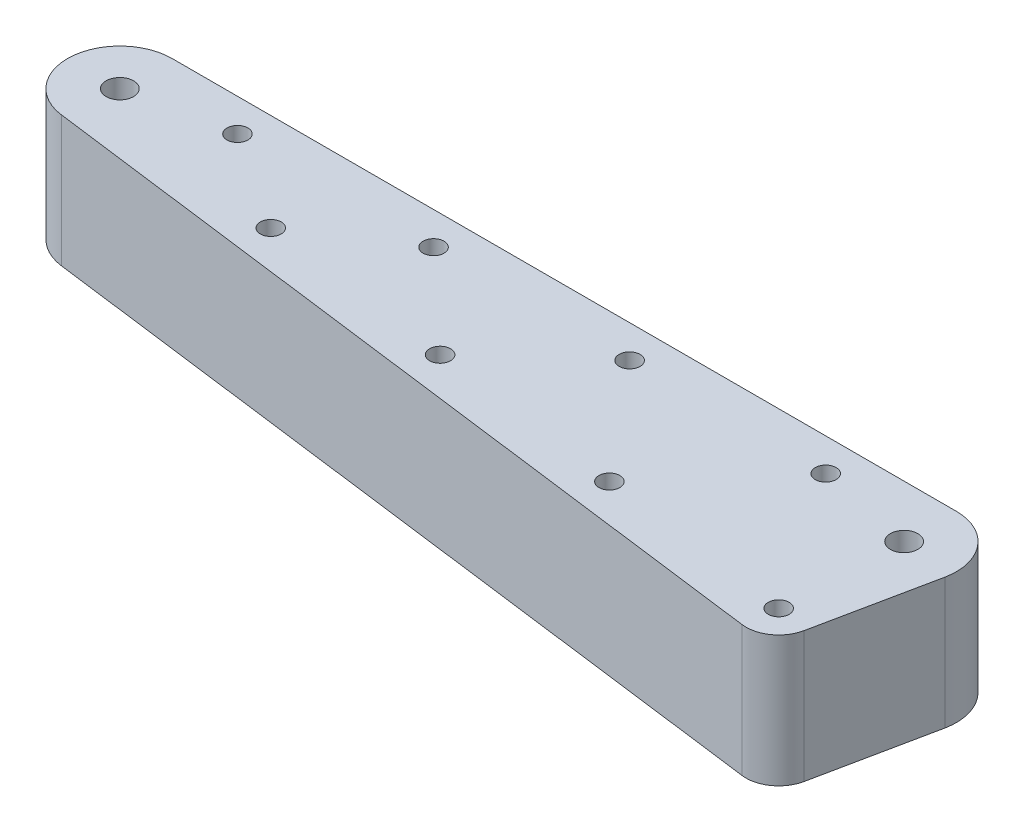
from build123d import *

# Parameters (mm, degrees)
SKETCH_1_R          = 2.1
SKETCH_1_R_2        = 1.6
EXTRUDE_1_DEPTH     = 4
SKETCH_2_R          = 1.6
CUT_EXTRUDE_1_DEPTH = 166.082101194
EXTRUDE_START       = 20
SKETCH_3_R          = 2.1
SKETCH_3_R_2        = 1.6
EXTRUDE_2_DEPTH     = 20
SKETCH_4_W          = 345
SKETCH_4_H          = 80
CUT_EXTRUDE_2_DEPTH = 4
CUT_EXTRUDE_3_DEPTH = 0.5


with BuildPart() as part:
    # Sketch 1 → Extrude 1 (new body)
    with BuildSketch(Plane(origin=(0, 0, 0), x_dir=(1, 0, 0), z_dir=(0, 1, 0))):
        with BuildLine():
            Line((153.614907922, -27.933920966), (-1.02610823, -7.933920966))
            ThreePointArc((-1.02610823, -7.933920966), (-7.98346315, 0.514116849), (0, 8))
            Line((0, 8), (120, 8))
            ThreePointArc((120, 8), (122.070552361, 7.72740661), (124, 6.92820323))
            Line((124, 6.92820323), (158.641016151, -13.07179677))
            ThreePointArc((158.641016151, -13.07179677), (162.219386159, -22.562871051), (153.614907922, -27.933920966))
        make_face()
        with Locations(Location((0, 0, 0), (0, 0, 270))):
            Circle(SKETCH_1_R, mode=Mode.SUBTRACT)
        with Locations(Location((154.641016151, -20, 0), (0, 0, 270))):
            Circle(SKETCH_1_R_2, mode=Mode.SUBTRACT)
        with Locations(Location((120, 0, 0), (0, 0, 270))):
            Circle(SKETCH_1_R, mode=Mode.SUBTRACT)
    extrude(amount=EXTRUDE_1_DEPTH)

    # Sketch 2 → Cut-Extrude 1 (cut, through all)
    with BuildSketch(Plane(origin=(0, 4, 0), x_dir=(1, 0, 0), z_dir=(0, 1, 0))):
        with Locations(Location((15, 3, 0), (0, 0, 270))):
            Circle(SKETCH_2_R)
        with Locations(Location((45, 3, 0), (0, 0, 270))):
            Circle(SKETCH_2_R)
        with Locations(Location((75, 3, 0), (0, 0, 270))):
            Circle(SKETCH_2_R)
        with Locations(Location((105, 3, 0), (0, 0, 270))):
            Circle(SKETCH_2_R)
        with Locations(Location((30, -6.90493983, 0), (0, 0, 270))):
            Circle(SKETCH_2_R)
        with Locations(Location((59.752203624, -10.752845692, 0), (0, 0, 270))):
            Circle(SKETCH_2_R)
        with Locations(Location((89.504407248, -14.600751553, 0), (0, 0, 270))):
            Circle(SKETCH_2_R)
        with Locations(Location((119.256610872, -18.448657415, 0), (0, 0, 270))):
            Circle(SKETCH_2_R)
    extrude(amount=-CUT_EXTRUDE_1_DEPTH, mode=Mode.SUBTRACT)

    # Sketch 3 → Extrude 2 (add)
    with BuildSketch(Plane(origin=(0, 4, 0), x_dir=(1, 0, 0), z_dir=(0, 1, 0)).offset(EXTRUDE_START)):
        with BuildLine():
            Line((-1.02610823, -7.933920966), (118.615293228, -23.407358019))
            ThreePointArc((118.615293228, -23.407358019), (122.159141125, -22.519937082), (124.153458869, -19.459043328))
            Line((124.153458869, -19.459043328), (127.834956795, -1.616617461))
            ThreePointArc((127.834956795, -1.616617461), (126.202134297, 5.053071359), (120, 8))
            Line((120, 8), (0, 8))
            ThreePointArc((0, 8), (-7.98346315, 0.514116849), (-1.02610823, -7.933920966))
        make_face()
        with Locations(Location((0, 0, 0), (0, 0, 270))):
            Circle(SKETCH_3_R, mode=Mode.SUBTRACT)
        with Locations(Location((120, 0, 0), (0, 0, 270))):
            Circle(SKETCH_3_R, mode=Mode.SUBTRACT)
        with Locations(Location((15, 3, 0), (0, 0, 270))):
            Circle(SKETCH_3_R_2, mode=Mode.SUBTRACT)
        with Locations(Location((30, -6.90493983, 0), (0, 0, 270))):
            Circle(SKETCH_3_R_2, mode=Mode.SUBTRACT)
        with Locations(Location((45, 3, 0), (0, 0, 270))):
            Circle(SKETCH_3_R_2, mode=Mode.SUBTRACT)
        with Locations(Location((75, 3, 0), (0, 0, 270))):
            Circle(SKETCH_3_R_2, mode=Mode.SUBTRACT)
        with Locations(Location((105, 3, 0), (0, 0, 270))):
            Circle(SKETCH_3_R_2, mode=Mode.SUBTRACT)
        with Locations(Location((59.752203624, -10.752845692, 0), (0, 0, 270))):
            Circle(SKETCH_3_R_2, mode=Mode.SUBTRACT)
        with Locations(Location((89.504407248, -14.600751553, 0), (0, 0, 270))):
            Circle(SKETCH_3_R_2, mode=Mode.SUBTRACT)
        with Locations(Location((119.256610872, -18.448657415, 0), (0, 0, 270))):
            Circle(SKETCH_3_R_2, mode=Mode.SUBTRACT)
    extrude(amount=-EXTRUDE_2_DEPTH)

    # Sketch 4 → Cut-Extrude 2 (cut)
    with BuildSketch(Plane.XZ):
        Rectangle(SKETCH_4_W, SKETCH_4_H)
    extrude(amount=-CUT_EXTRUDE_2_DEPTH, mode=Mode.SUBTRACT)

    # Sketch 5 → Cut-Extrude 3 (cut)
    with BuildSketch(Plane(origin=(0, 0, -8), x_dir=(-1, 0, 0), z_dir=(0, 0, -1))):
        with BuildLine():
            Line((-71.476171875, 9.853125), (-73.286328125, 12.5))
            Line((-73.286328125, 12.5), (-75.14296875, 9.853125))
            add(Edge.make_bspline(
                [(-75.14296875, 9.853125), (-75.207101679, 9.767004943), (-75.327352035, 9.605528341), (-75.503951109, 9.386404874), (-75.665851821, 9.206734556), (-75.815069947, 9.061897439), (-75.968594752, 8.948558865), (-76.14250525, 8.881233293), (-76.330412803, 8.830091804), (-76.463278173, 8.826736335), (-76.53203125, 8.825)],
                knots=[0, 0, 0, 0, 1.424737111, 2.671406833, 3.733105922, 4.631441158, 5.430042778, 6.243165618, 7.090901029, 8, 8, 8, 8], degree=3))
            add(Edge.make_bspline(
                [(-76.53203125, 8.825), (-76.608942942, 8.828636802), (-76.758444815, 8.835706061), (-76.973915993, 8.892209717), (-77.171326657, 8.985994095), (-77.343919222, 9.117308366), (-77.488320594, 9.27051184), (-77.594288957, 9.439472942), (-77.662543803, 9.620271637), (-77.670818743, 9.745897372), (-77.675, 9.809375)],
                knots=[0, 0, 0, 0, 1.105933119, 2.149726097, 3.182576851, 4.23220824, 5.253409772, 6.19634527, 7.08862842, 8, 8, 8, 8], degree=3))
            add(Edge.make_bspline(
                [(-77.675, 9.809375), (-77.667023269, 9.882975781), (-77.648970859, 10.049544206), (-77.541954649, 10.312357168), (-77.381898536, 10.617949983), (-77.240825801, 10.82704845), (-77.163671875, 10.94140625)],
                knots=[0, 0, 0, 0, 0.704218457, 1.593740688, 2.683995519, 4, 4, 4, 4], degree=3))
            Line((-77.163671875, 10.94140625), (-74.905078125, 14.20078125))
            Line((-74.905078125, 14.20078125), (-76.906640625, 16.877734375))
            add(Edge.make_bspline(
                [(-76.906640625, 16.877734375), (-76.986201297, 16.983368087), (-77.133841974, 17.179392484), (-77.29745842, 17.482095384), (-77.406162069, 17.761869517), (-77.42169393, 17.946094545), (-77.42890625, 18.031640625)],
                knots=[0, 0, 0, 0, 1.230820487, 2.284032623, 3.203179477, 4, 4, 4, 4], degree=3))
            add(Edge.make_bspline(
                [(-77.42890625, 18.031640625), (-77.425248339, 18.093127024), (-77.417984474, 18.215226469), (-77.358374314, 18.392152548), (-77.255423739, 18.552276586), (-77.122666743, 18.700031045), (-76.955444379, 18.824496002), (-76.758485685, 18.909606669), (-76.539981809, 18.968700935), (-76.385720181, 18.972837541), (-76.305078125, 18.975)],
                knots=[0, 0, 0, 0, 0.902161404, 1.791508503, 2.705716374, 3.682245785, 4.697406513, 5.740365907, 6.818750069, 8, 8, 8, 8], degree=3))
            add(Edge.make_bspline(
                [(-76.305078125, 18.975), (-76.234552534, 18.973154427), (-76.098187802, 18.969585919), (-75.904795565, 18.919991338), (-75.727424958, 18.847808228), (-75.570779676, 18.733716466), (-75.417569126, 18.59115351), (-75.254520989, 18.41980828), (-75.081848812, 18.212125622), (-74.966440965, 18.060374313), (-74.905078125, 17.9796875)],
                knots=[0, 0, 0, 0, 0.940325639, 1.81816631, 2.653443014, 3.485066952, 4.390882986, 5.451095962, 6.64473694, 8, 8, 8, 8], degree=3))
            Line((-74.905078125, 17.9796875), (-73.286328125, 15.825))
            Line((-73.286328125, 15.825), (-71.7140625, 17.9796875))
            add(Edge.make_bspline(
                [(-71.7140625, 17.9796875), (-71.650997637, 18.063202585), (-71.533354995, 18.21899354), (-71.357100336, 18.429668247), (-71.194070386, 18.601816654), (-71.041035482, 18.742690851), (-70.881735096, 18.849563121), (-70.707553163, 18.923359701), (-70.515945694, 18.968440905), (-70.382676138, 18.972770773), (-70.3140625, 18.975)],
                knots=[0, 0, 0, 0, 1.399066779, 2.609851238, 3.670040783, 4.567684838, 5.38560641, 6.220864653, 7.084014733, 8, 8, 8, 8], degree=3))
            add(Edge.make_bspline(
                [(-70.3140625, 18.975), (-70.234438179, 18.972411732), (-70.081513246, 18.967440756), (-69.862789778, 18.913462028), (-69.666236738, 18.825472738), (-69.494460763, 18.705016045), (-69.351834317, 18.562200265), (-69.247793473, 18.399097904), (-69.180254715, 18.220857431), (-69.1741673, 18.095123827), (-69.17109375, 18.031640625)],
                knots=[0, 0, 0, 0, 1.157705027, 2.223465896, 3.257330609, 4.277467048, 5.263161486, 6.176468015, 7.079294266, 8, 8, 8, 8], degree=3))
            add(Edge.make_bspline(
                [(-69.17109375, 18.031640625), (-69.177039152, 17.938560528), (-69.189053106, 17.750472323), (-69.282136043, 17.527124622), (-69.381282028, 17.349406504), (-69.474007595, 17.202066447), (-69.587457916, 17.043978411), (-69.669436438, 16.934987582), (-69.7125, 16.877734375)],
                knots=[0, 0, 0, 0, 1.28499373, 2.596604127, 3.303422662, 4.109616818, 5.006976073, 6, 6, 6, 6], degree=3))
            Line((-69.7125, 16.877734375), (-71.7140625, 14.20078125))
            Line((-71.7140625, 14.20078125), (-69.45546875, 10.94140625))
            add(Edge.make_bspline(
                [(-69.45546875, 10.94140625), (-69.414369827, 10.879492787), (-69.335657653, 10.760916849), (-69.22418585, 10.589975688), (-69.134882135, 10.426851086), (-69.057143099, 10.278640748), (-68.9989363, 10.140387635), (-68.95734521, 10.014350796), (-68.930554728, 9.898907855), (-68.926776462, 9.824989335), (-68.925, 9.790234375)],
                knots=[0, 0, 0, 0, 1.39038648, 2.66285187, 3.815549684, 4.867906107, 5.792614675, 6.617622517, 7.350034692, 8, 8, 8, 8], degree=3))
            add(Edge.make_bspline(
                [(-68.925, 9.790234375), (-68.929395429, 9.72594496), (-68.938012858, 9.599902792), (-69.001629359, 9.417564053), (-69.108859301, 9.251863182), (-69.252677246, 9.102906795), (-69.427394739, 8.981984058), (-69.621998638, 8.887735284), (-69.83938662, 8.836741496), (-69.990253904, 8.82899195), (-70.06796875, 8.825)],
                knots=[0, 0, 0, 0, 0.928993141, 1.821331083, 2.757780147, 3.76489693, 4.796488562, 5.81689638, 6.87543835, 8, 8, 8, 8], degree=3))
            add(Edge.make_bspline(
                [(-70.06796875, 8.825), (-70.136586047, 8.828239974), (-70.270897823, 8.834581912), (-70.463731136, 8.881503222), (-70.64013018, 8.960012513), (-70.80374877, 9.070300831), (-70.957767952, 9.219680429), (-71.121771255, 9.398677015), (-71.299649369, 9.610931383), (-71.41517115, 9.769430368), (-71.476171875, 9.853125)],
                knots=[0, 0, 0, 0, 0.903614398, 1.768738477, 2.59671967, 3.436119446, 4.353908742, 5.416285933, 6.635682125, 8, 8, 8, 8], degree=3))
        make_face()
        with BuildLine():
            Line((-60.303515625, 16.0328125), (-64.908203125, 10.925))
            Line((-64.908203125, 10.925), (-59.980859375, 10.925))
            add(Edge.make_bspline(
                [(-59.980859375, 10.925), (-59.886695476, 10.922536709), (-59.709474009, 10.917900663), (-59.46128703, 10.865796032), (-59.24914554, 10.779370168), (-59.075972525, 10.656061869), (-58.939700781, 10.508038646), (-58.844802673, 10.335070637), (-58.785200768, 10.144108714), (-58.778449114, 10.00942752), (-58.775, 9.940625)],
                knots=[0, 0, 0, 0, 1.283919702, 2.416405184, 3.442575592, 4.388657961, 5.296057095, 6.16510038, 7.062632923, 8, 8, 8, 8], degree=3))
            add(Edge.make_bspline(
                [(-58.775, 9.940625), (-58.778829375, 9.874689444), (-58.786309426, 9.745895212), (-58.840571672, 9.560614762), (-58.941772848, 9.399086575), (-59.073133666, 9.253852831), (-59.246654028, 9.138230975), (-59.458071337, 9.055954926), (-59.707111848, 9.007932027), (-59.885843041, 9.002753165), (-59.980859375, 9)],
                knots=[0, 0, 0, 0, 0.916513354, 1.790257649, 2.648524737, 3.545118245, 4.49390242, 5.517321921, 6.680169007, 8, 8, 8, 8], degree=3))
            Line((-59.980859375, 9), (-66.79765625, 9))
            add(Edge.make_bspline(
                [(-66.79765625, 9), (-66.909996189, 9.003302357), (-67.12176622, 9.009527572), (-67.418441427, 9.064857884), (-67.669107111, 9.163487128), (-67.876178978, 9.298382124), (-68.031275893, 9.473611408), (-68.146995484, 9.673717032), (-68.213674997, 9.904631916), (-68.221128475, 10.066890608), (-68.225, 10.151171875)],
                knots=[0, 0, 0, 0, 1.294646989, 2.440516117, 3.459144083, 4.383062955, 5.261017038, 6.131708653, 7.029562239, 8, 8, 8, 8], degree=3))
            add(Edge.make_bspline(
                [(-68.225, 10.151171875), (-68.221475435, 10.204343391), (-68.214239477, 10.313504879), (-68.165301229, 10.475427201), (-68.086670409, 10.637636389), (-67.993297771, 10.770579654), (-67.901317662, 10.887194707), (-67.811892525, 10.991362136), (-67.709048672, 11.114388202), (-67.588557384, 11.253710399), (-67.450711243, 11.409486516), (-67.299683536, 11.585351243), (-67.125142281, 11.772169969), (-67.006978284, 11.905447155), (-66.9453125, 11.975)],
                knots=[0, 0, 0, 0, 0.843414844, 1.731536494, 2.663118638, 3.694160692, 4.301839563, 5.020418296, 5.872348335, 6.846633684, 7.943359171, 9.173432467, 10.524910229, 12, 12, 12, 12], degree=3))
            add(Edge.make_bspline(
                [(-66.9453125, 11.975), (-66.810442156, 12.123590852), (-66.547212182, 12.413599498), (-66.160840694, 12.838418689), (-65.793402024, 13.241173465), (-65.336341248, 13.741180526), (-64.800435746, 14.328270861), (-64.287798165, 14.893026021), (-63.910181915, 15.31470756), (-63.65703609, 15.601121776), (-63.42863341, 15.861345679), (-63.224251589, 16.099834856), (-63.039653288, 16.31487343), (-62.877892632, 16.51658872), (-62.733524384, 16.699798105), (-62.646551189, 16.819156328), (-62.605859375, 16.875)],
                knots=[0, 0, 0, 0, 1.287276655, 2.512411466, 3.683665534, 4.784520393, 6.858009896, 8.782831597, 9.677227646, 10.489077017, 11.234911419, 11.898264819, 12.503914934, 13.052709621, 13.556794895, 14, 14, 14, 14], degree=3))
            Line((-62.605859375, 16.875), (-66.34375, 16.875))
            add(Edge.make_bspline(
                [(-66.34375, 16.875), (-66.465011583, 16.876176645), (-66.691492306, 16.878374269), (-67.008980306, 16.904352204), (-67.278434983, 16.95138743), (-67.508197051, 17.006497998), (-67.697197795, 17.114241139), (-67.827522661, 17.290562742), (-67.90037197, 17.525009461), (-67.906936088, 17.698381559), (-67.910546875, 17.79375)],
                knots=[0, 0, 0, 0, 1.378470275, 2.57457421, 3.615406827, 4.487892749, 5.250242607, 6.033638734, 6.918344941, 8, 8, 8, 8], degree=3))
            add(Edge.make_bspline(
                [(-67.910546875, 17.79375), (-67.907023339, 17.86704459), (-67.900263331, 18.007662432), (-67.844160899, 18.207507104), (-67.749941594, 18.383988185), (-67.615270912, 18.533694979), (-67.447115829, 18.655464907), (-67.244039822, 18.739950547), (-67.011793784, 18.792646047), (-66.846273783, 18.797468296), (-66.759375, 18.8)],
                knots=[0, 0, 0, 0, 1.015207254, 1.947705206, 2.852719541, 3.7660833, 4.716910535, 5.707900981, 6.79663718, 8, 8, 8, 8], degree=3))
            Line((-66.759375, 18.8), (-60.984375, 18.8))
            add(Edge.make_bspline(
                [(-60.984375, 18.8), (-60.858527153, 18.796518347), (-60.621478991, 18.789960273), (-60.287941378, 18.750856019), (-60.002748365, 18.669373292), (-59.758780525, 18.566540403), (-59.558638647, 18.418961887), (-59.420147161, 18.21386688), (-59.340689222, 17.960665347), (-59.331992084, 17.777045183), (-59.32734375, 17.67890625)],
                knots=[0, 0, 0, 0, 1.320440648, 2.487194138, 3.510092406, 4.421497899, 5.253218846, 6.077878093, 6.972689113, 8, 8, 8, 8], degree=3))
            add(Edge.make_bspline(
                [(-59.32734375, 17.67890625), (-59.331940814, 17.607360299), (-59.341474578, 17.458982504), (-59.407991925, 17.244961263), (-59.490725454, 17.047094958), (-59.593007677, 16.869641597), (-59.725544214, 16.70385332), (-59.880633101, 16.511066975), (-60.078986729, 16.285093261), (-60.224112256, 16.122030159), (-60.303515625, 16.0328125)],
                knots=[0, 0, 0, 0, 0.87583533, 1.816378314, 2.727200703, 3.503097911, 4.316290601, 5.324632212, 6.53621054, 8, 8, 8, 8], degree=3))
        make_face()
        with BuildLine():
            Line((-48.975, 13.73046875), (-48.975, 10.402734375))
            add(Edge.make_bspline(
                [(-48.975, 10.402734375), (-48.978512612, 10.279353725), (-48.985158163, 10.045928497), (-49.0522326, 9.719481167), (-49.167158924, 9.441500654), (-49.328364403, 9.214227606), (-49.528737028, 9.04002779), (-49.75945865, 8.912874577), (-50.021345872, 8.837954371), (-50.205892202, 8.829410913), (-50.301171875, 8.825)],
                knots=[0, 0, 0, 0, 1.266235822, 2.395605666, 3.402519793, 4.335311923, 5.231091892, 6.106879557, 7.022598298, 8, 8, 8, 8], degree=3))
            add(Edge.make_bspline(
                [(-50.301171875, 8.825), (-50.393766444, 8.829332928), (-50.573039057, 8.837721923), (-50.828032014, 8.914134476), (-51.054636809, 9.040034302), (-51.252191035, 9.214470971), (-51.410782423, 9.441738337), (-51.522074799, 9.720110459), (-51.590070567, 10.045844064), (-51.596566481, 10.279324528), (-51.6, 10.402734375)],
                knots=[0, 0, 0, 0, 0.958914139, 1.856556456, 2.73282327, 3.630465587, 4.567111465, 5.580438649, 6.721102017, 8, 8, 8, 8], degree=3))
            Line((-51.6, 10.402734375), (-51.6, 14.3921875))
            add(Edge.make_bspline(
                [(-51.6, 14.3921875), (-51.599855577, 14.540774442), (-51.599583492, 14.820705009), (-51.614991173, 15.21356126), (-51.631750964, 15.553924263), (-51.66041963, 15.846547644), (-51.706302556, 16.102662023), (-51.775469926, 16.332494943), (-51.878462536, 16.536812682), (-52.007143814, 16.718979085), (-52.17279803, 16.871402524), (-52.384701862, 16.976606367), (-52.63553448, 17.038928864), (-52.816402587, 17.0461587), (-52.9125, 17.05)],
                knots=[0, 0, 0, 0, 1.575587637, 2.968330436, 4.168822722, 5.189306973, 6.084130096, 6.924849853, 7.72456167, 8.499892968, 9.280149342, 10.084230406, 10.982128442, 12, 12, 12, 12], degree=3))
            add(Edge.make_bspline(
                [(-52.9125, 17.05), (-53.011060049, 17.047349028), (-53.199865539, 17.042270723), (-53.46987993, 17.004726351), (-53.713764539, 16.939405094), (-53.93241053, 16.846101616), (-54.125282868, 16.726223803), (-54.290403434, 16.577711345), (-54.428018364, 16.403344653), (-54.540254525, 16.202971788), (-54.63216058, 15.978953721), (-54.711015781, 15.732822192), (-54.775543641, 15.463792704), (-54.830099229, 15.172669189), (-54.87404628, 14.858867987), (-54.902567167, 14.521115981), (-54.922907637, 14.160926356), (-54.9242893, 13.91279184), (-54.925, 13.78515625)],
                knots=[0, 0, 0, 0, 1.072726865, 2.054957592, 2.959985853, 3.813338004, 4.633692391, 5.420603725, 6.218633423, 7.040726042, 7.912341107, 8.850536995, 9.851629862, 10.921921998, 12.073946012, 13.299226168, 14.610774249, 16, 16, 16, 16], degree=3))
            Line((-54.925, 13.78515625), (-54.925, 10.402734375))
            add(Edge.make_bspline(
                [(-54.925, 10.402734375), (-54.928293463, 10.280193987), (-54.934498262, 10.049331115), (-55.003943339, 9.726791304), (-55.114331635, 9.448443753), (-55.275783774, 9.221152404), (-55.471984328, 9.04233038), (-55.701052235, 8.917143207), (-55.956956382, 8.836901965), (-56.138441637, 8.829049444), (-56.23203125, 8.825)],
                knots=[0, 0, 0, 0, 1.267438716, 2.387821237, 3.399536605, 4.347850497, 5.250359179, 6.125232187, 7.033206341, 8, 8, 8, 8], degree=3))
            add(Edge.make_bspline(
                [(-56.23203125, 8.825), (-56.324574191, 8.82947958), (-56.504622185, 8.83819488), (-56.762335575, 8.913498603), (-56.990118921, 9.043117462), (-57.191943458, 9.217802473), (-57.354964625, 9.445693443), (-57.46830063, 9.723719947), (-57.541270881, 10.046283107), (-57.54697491, 10.277418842), (-57.55, 10.4)],
                knots=[0, 0, 0, 0, 0.955872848, 1.859709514, 2.746023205, 3.64789137, 4.600178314, 5.613935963, 6.734568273, 8, 8, 8, 8], degree=3))
            Line((-57.55, 10.4), (-57.55, 17.555859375))
            add(Edge.make_bspline(
                [(-57.55, 17.555859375), (-57.545735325, 17.666405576), (-57.537663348, 17.875642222), (-57.479775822, 18.169957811), (-57.37508939, 18.422637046), (-57.22821339, 18.630681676), (-57.047785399, 18.79659913), (-56.836114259, 18.911598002), (-56.598538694, 18.984098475), (-56.431284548, 18.990700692), (-56.344140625, 18.994140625)],
                knots=[0, 0, 0, 0, 1.249103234, 2.364243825, 3.370552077, 4.316533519, 5.220766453, 6.115207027, 7.017972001, 8, 8, 8, 8], degree=3))
            add(Edge.make_bspline(
                [(-56.344140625, 18.994140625), (-56.259886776, 18.99002881), (-56.09705337, 18.982082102), (-55.862496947, 18.917533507), (-55.652402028, 18.805450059), (-55.466124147, 18.654854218), (-55.309016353, 18.467464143), (-55.200268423, 18.240893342), (-55.132609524, 17.983557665), (-55.125561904, 17.801494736), (-55.121875, 17.70625)],
                knots=[0, 0, 0, 0, 1.012533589, 1.956875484, 2.898540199, 3.857472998, 4.823338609, 5.81384557, 6.856331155, 8, 8, 8, 8], degree=3))
            Line((-55.121875, 17.70625), (-55.121875, 17.468359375))
            add(Edge.make_bspline(
                [(-55.121875, 17.468359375), (-55.013330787, 17.592191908), (-54.802548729, 17.832662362), (-54.4511173, 18.14053993), (-54.095368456, 18.405590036), (-53.721534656, 18.614838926), (-53.332861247, 18.778434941), (-52.924268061, 18.893343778), (-52.494769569, 18.963688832), (-52.20092402, 18.971181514), (-52.051171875, 18.975)],
                knots=[0, 0, 0, 0, 1.114688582, 2.164614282, 3.159066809, 4.115906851, 5.059923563, 6.010102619, 6.985891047, 8, 8, 8, 8], degree=3))
            add(Edge.make_bspline(
                [(-52.051171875, 18.975), (-51.897800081, 18.97007631), (-51.600400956, 18.960528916), (-51.170067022, 18.892550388), (-50.773434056, 18.775392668), (-50.410151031, 18.60906344), (-50.077702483, 18.396673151), (-49.778422, 18.134191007), (-49.508801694, 17.823926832), (-49.3602662, 17.589005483), (-49.283984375, 17.468359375)],
                knots=[0, 0, 0, 0, 1.11017006, 2.152700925, 3.14437276, 4.0951572, 5.035997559, 5.99009648, 6.967794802, 8, 8, 8, 8], degree=3))
            add(Edge.make_bspline(
                [(-49.283984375, 17.468359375), (-49.176607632, 17.589635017), (-48.967423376, 17.825896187), (-48.629062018, 18.139430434), (-48.275172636, 18.398059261), (-47.912227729, 18.612714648), (-47.529804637, 18.776229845), (-47.12887625, 18.888977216), (-46.709229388, 18.964757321), (-46.422346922, 18.971542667), (-46.276171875, 18.975)],
                knots=[0, 0, 0, 0, 1.115453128, 2.173051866, 3.170174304, 4.129679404, 5.07202097, 6.025901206, 6.994138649, 8, 8, 8, 8], degree=3))
            add(Edge.make_bspline(
                [(-46.276171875, 18.975), (-46.10815829, 18.970759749), (-45.781211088, 18.962508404), (-45.31010645, 18.884926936), (-44.874642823, 18.758627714), (-44.477113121, 18.584917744), (-44.120987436, 18.362283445), (-43.811208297, 18.094786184), (-43.548245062, 17.782110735), (-43.416820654, 17.544641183), (-43.350390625, 17.424609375)],
                knots=[0, 0, 0, 0, 1.152917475, 2.24352777, 3.267398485, 4.25932605, 5.212614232, 6.139888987, 7.05978478, 8, 8, 8, 8], degree=3))
            add(Edge.make_bspline(
                [(-43.350390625, 17.424609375), (-43.323566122, 17.36494541), (-43.266921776, 17.238955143), (-43.205295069, 17.030556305), (-43.145472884, 16.800541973), (-43.104470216, 16.544860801), (-43.069025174, 16.26583131), (-43.040577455, 15.962240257), (-43.028903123, 15.633686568), (-43.026331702, 15.406644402), (-43.025, 15.2890625)],
                knots=[0, 0, 0, 0, 0.72077696, 1.522039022, 2.392527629, 3.341243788, 4.375000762, 5.495464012, 6.702936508, 8, 8, 8, 8], degree=3))
            Line((-43.025, 15.2890625), (-43.025, 10.402734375))
            add(Edge.make_bspline(
                [(-43.025, 10.402734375), (-43.028508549, 10.279348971), (-43.035146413, 10.045914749), (-43.102271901, 9.719527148), (-43.217032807, 9.441353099), (-43.378390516, 9.215288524), (-43.576138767, 9.039125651), (-43.806127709, 8.913631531), (-44.065747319, 8.837803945), (-44.248567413, 8.829360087), (-44.34296875, 8.825)],
                knots=[0, 0, 0, 0, 1.270260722, 2.40322042, 3.413335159, 4.349092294, 5.240672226, 6.119243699, 7.028849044, 8, 8, 8, 8], degree=3))
            add(Edge.make_bspline(
                [(-44.34296875, 8.825), (-44.434740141, 8.829104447), (-44.613535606, 8.837101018), (-44.866527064, 8.917666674), (-45.095151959, 9.042993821), (-45.293472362, 9.220958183), (-45.458488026, 9.447556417), (-45.567391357, 9.727264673), (-45.641567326, 10.048878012), (-45.647077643, 10.280104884), (-45.65, 10.402734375)],
                knots=[0, 0, 0, 0, 0.949562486, 1.850004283, 2.726333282, 3.637390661, 4.592775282, 5.606174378, 6.730451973, 8, 8, 8, 8], degree=3))
            Line((-45.65, 10.402734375), (-45.65, 14.6109375))
            add(Edge.make_bspline(
                [(-45.65, 14.6109375), (-45.65165476, 14.73853022), (-45.654799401, 14.981002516), (-45.661844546, 15.325135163), (-45.689477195, 15.628433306), (-45.715448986, 15.896082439), (-45.764205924, 16.135724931), (-45.842031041, 16.35276598), (-45.955511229, 16.547792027), (-46.093244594, 16.725456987), (-46.270996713, 16.87406843), (-46.491295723, 16.979594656), (-46.750826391, 17.037738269), (-46.93577275, 17.045758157), (-47.03359375, 17.05)],
                knots=[0, 0, 0, 0, 1.423520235, 2.705203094, 3.837439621, 4.819854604, 5.703211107, 6.558808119, 7.378494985, 8.210510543, 9.055347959, 9.937474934, 10.909098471, 12, 12, 12, 12], degree=3))
            add(Edge.make_bspline(
                [(-47.03359375, 17.05), (-47.116838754, 17.046181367), (-47.282394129, 17.038586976), (-47.527712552, 16.981048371), (-47.765848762, 16.887506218), (-47.994382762, 16.758872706), (-48.206954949, 16.601121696), (-48.397892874, 16.41600431), (-48.563760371, 16.204314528), (-48.651631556, 16.046858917), (-48.69609375, 15.9671875)],
                knots=[0, 0, 0, 0, 0.958008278, 1.905260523, 2.885719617, 3.896064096, 4.916337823, 5.9258641, 6.95050202, 8, 8, 8, 8], degree=3))
            add(Edge.make_bspline(
                [(-48.69609375, 15.9671875), (-48.719050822, 15.910140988), (-48.768529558, 15.787190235), (-48.823450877, 15.582538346), (-48.869748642, 15.347648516), (-48.906134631, 15.082665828), (-48.940206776, 14.78749909), (-48.961186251, 14.461733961), (-48.970651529, 14.106046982), (-48.973511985, 13.858988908), (-48.975, 13.73046875)],
                knots=[0, 0, 0, 0, 0.650583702, 1.402184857, 2.238696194, 3.184464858, 4.2331, 5.384065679, 6.63918517, 8, 8, 8, 8], degree=3))
        make_face()
    extrude(amount=-CUT_EXTRUDE_3_DEPTH, mode=Mode.SUBTRACT)


solid = part.part
